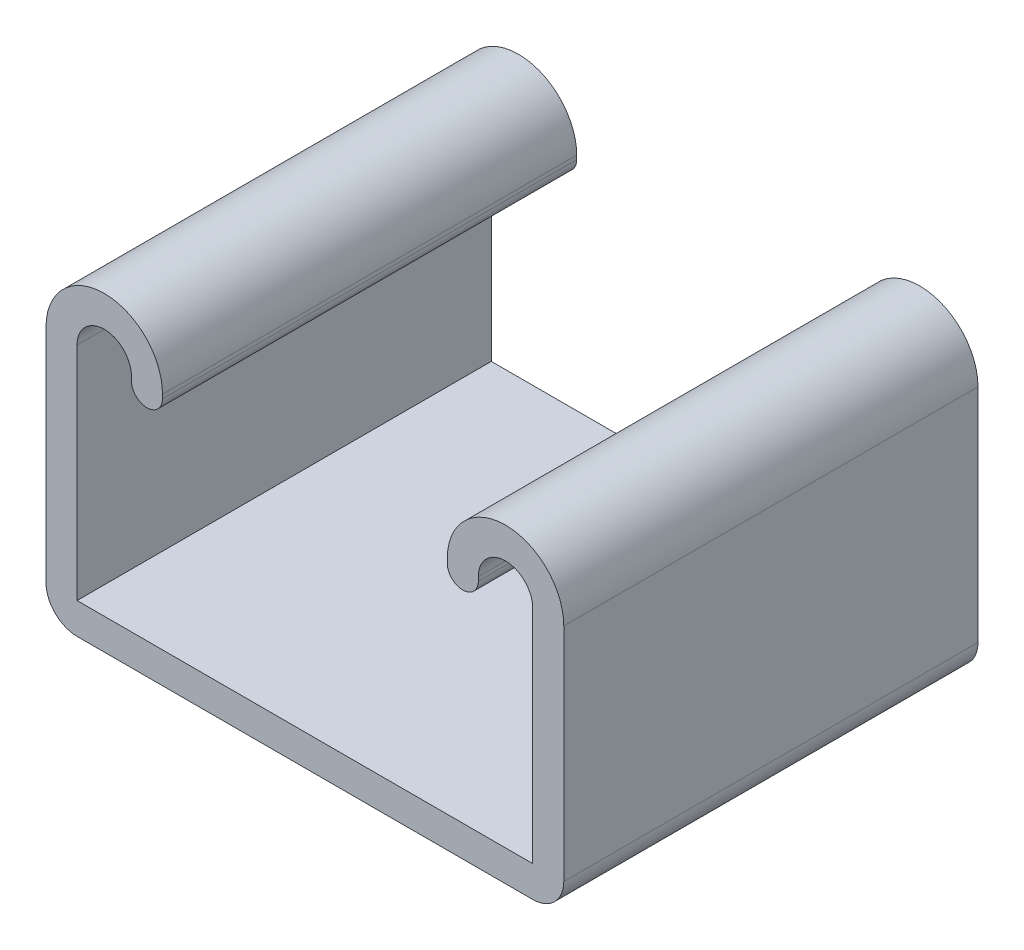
from build123d import *

# Parameters (mm, degrees)
BASE_EXTRUDE_DEPTH = 12.7


with BuildPart() as part:
    # Sketch1 → Base-Extrude (new, symmetric)
    with BuildSketch(Plane.XY):
        with BuildLine():
            Line((-15.875, 7.604125), (-15.875, -5.969))
            ThreePointArc((-15.875, -5.969), (-15.317038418, -7.316038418), (-13.97, -7.874))
            Line((-13.97, -7.874), (13.97, -7.874))
            ThreePointArc((13.97, -7.874), (15.317038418, -7.316038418), (15.875, -5.969))
            Line((15.875, -5.969), (15.875, 7.604125))
            ThreePointArc((15.875, 7.604125), (12.303125, 11.176), (8.73125, 7.604125))
            Line((8.73125, 7.604125), (8.73125, 7.366))
            ThreePointArc((8.73125, 7.366), (9.68375, 6.4135), (10.63625, 7.366))
            Line((10.63625, 7.366), (10.63625, 7.604125))
            ThreePointArc((10.63625, 7.604125), (12.303125, 9.271), (13.97, 7.604125))
            Line((13.97, 7.604125), (13.97, -5.969))
            Line((13.97, -5.969), (-13.97, -5.969))
            Line((-13.97, -5.969), (-13.97, 7.604125))
            ThreePointArc((-13.97, 7.604125), (-12.303125, 9.271), (-10.63625, 7.604125))
            Line((-10.63625, 7.604125), (-10.63625, 7.366))
            ThreePointArc((-10.63625, 7.366), (-9.68375, 6.4135), (-8.73125, 7.366))
            Line((-8.73125, 7.366), (-8.73125, 7.604125))
            ThreePointArc((-8.73125, 7.604125), (-12.303125, 11.176), (-15.875, 7.604125))
        make_face()
    extrude(amount=BASE_EXTRUDE_DEPTH, both=True)


solid = part.part
